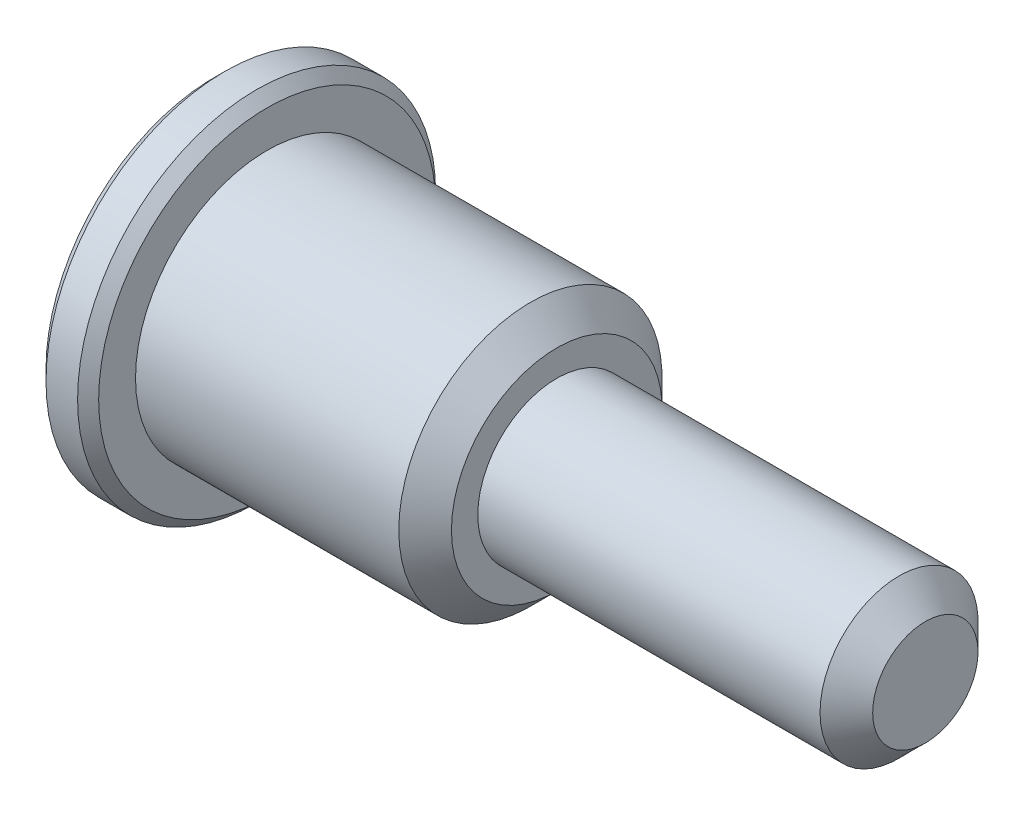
ISO-10303-21;
HEADER;
FILE_DESCRIPTION(('STEP AP214'),'2;1');
FILE_NAME('part.step','',(''),(''),'','','');
FILE_SCHEMA(('AUTOMOTIVE_DESIGN { 1 0 10303 214 1 1 1 1 }'));
ENDSEC;
DATA;
#1=APPLICATION_CONTEXT('core data for automotive mechanical design processes');
#2=APPLICATION_PROTOCOL_DEFINITION('international standard','automotive_design',2000,#1);
#3=PRODUCT_CONTEXT('',#1,'mechanical');
#4=PRODUCT('Part','Part','',(#3));
#5=PRODUCT_RELATED_PRODUCT_CATEGORY('part','',(#4));
#6=PRODUCT_DEFINITION_FORMATION('','',#4);
#7=PRODUCT_DEFINITION_CONTEXT('part definition',#1,'design');
#8=PRODUCT_DEFINITION('design','',#6,#7);
#9=PRODUCT_DEFINITION_SHAPE('','',#8);
#10=(LENGTH_UNIT() NAMED_UNIT(*) SI_UNIT(.MILLI.,.METRE.));
#11=(NAMED_UNIT(*) PLANE_ANGLE_UNIT() SI_UNIT($,.RADIAN.));
#12=(NAMED_UNIT(*) SI_UNIT($,.STERADIAN.) SOLID_ANGLE_UNIT());
#13=UNCERTAINTY_MEASURE_WITH_UNIT(LENGTH_MEASURE(1.E-05),#10,'distance_accuracy_value','');
#14=(GEOMETRIC_REPRESENTATION_CONTEXT(3) GLOBAL_UNCERTAINTY_ASSIGNED_CONTEXT((#13)) GLOBAL_UNIT_ASSIGNED_CONTEXT((#10,
#11,#12)) REPRESENTATION_CONTEXT('',''));
#15=CARTESIAN_POINT('',(0.,0.,0.));
#16=DIRECTION('',(0.,0.,1.));
#17=DIRECTION('',(1.,0.,0.));
#18=AXIS2_PLACEMENT_3D('',#15,#16,#17);
#19=CARTESIAN_POINT('',(0.,0.,0.));
#20=DIRECTION('',(1.,0.,0.));
#21=DIRECTION('',(0.,0.,-1.));
#22=AXIS2_PLACEMENT_3D('',#19,#20,#21);
#23=PLANE('',#22);
#24=CARTESIAN_POINT('',(0.,0.,0.));
#25=DIRECTION('',(1.,0.,0.));
#26=DIRECTION('',(0.,0.,-1.));
#27=AXIS2_PLACEMENT_3D('',#24,#25,#26);
#28=CIRCLE('',#27,3.2);
#29=CARTESIAN_POINT('',(0.,0.,-3.2));
#30=VERTEX_POINT('',#29);
#31=EDGE_CURVE('E10',#30,#30,#28,.F.);
#32=ORIENTED_EDGE('',*,*,#31,.T.);
#33=EDGE_LOOP('',(#32));
#34=FACE_BOUND('',#33,.T.);
#35=ADVANCED_FACE('F33',(#34),#23,.F.);
#36=CARTESIAN_POINT('',(0.,0.,0.));
#37=DIRECTION('',(-1.,0.,0.));
#38=DIRECTION('',(0.,0.,1.));
#39=AXIS2_PLACEMENT_3D('',#36,#37,#38);
#40=CYLINDRICAL_SURFACE('',#39,3.4);
#41=CARTESIAN_POINT('',(0.800000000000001,0.,0.));
#42=DIRECTION('',(-1.,0.,0.));
#43=DIRECTION('',(0.,0.,1.));
#44=AXIS2_PLACEMENT_3D('',#41,#42,#43);
#45=CIRCLE('',#44,3.4);
#46=CARTESIAN_POINT('',(0.800000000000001,0.,3.4));
#47=VERTEX_POINT('',#46);
#48=EDGE_CURVE('E44',#47,#47,#45,.T.);
#49=ORIENTED_EDGE('',*,*,#48,.T.);
#50=EDGE_LOOP('',(#49));
#51=FACE_BOUND('',#50,.T.);
#52=CARTESIAN_POINT('',(0.199999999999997,0.,0.));
#53=DIRECTION('',(1.,0.,0.));
#54=DIRECTION('',(0.,0.,-1.));
#55=AXIS2_PLACEMENT_3D('',#52,#53,#54);
#56=CIRCLE('',#55,3.4);
#57=CARTESIAN_POINT('',(0.199999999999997,0.,-3.4));
#58=VERTEX_POINT('',#57);
#59=EDGE_CURVE('E48',#58,#58,#56,.T.);
#60=ORIENTED_EDGE('',*,*,#59,.T.);
#61=EDGE_LOOP('',(#60));
#62=FACE_BOUND('',#61,.T.);
#63=ADVANCED_FACE('F90',(#51,#62),#40,.T.);
#64=CARTESIAN_POINT('',(1.,3.4,0.));
#65=DIRECTION('',(-1.,0.,0.));
#66=DIRECTION('',(0.,0.,1.));
#67=AXIS2_PLACEMENT_3D('',#64,#65,#66);
#68=PLANE('',#67);
#69=CARTESIAN_POINT('',(1.,0.,0.));
#70=DIRECTION('',(-1.,0.,0.));
#71=DIRECTION('',(0.,0.,1.));
#72=AXIS2_PLACEMENT_3D('',#69,#70,#71);
#73=CIRCLE('',#72,3.2);
#74=CARTESIAN_POINT('',(1.,0.,3.2));
#75=VERTEX_POINT('',#74);
#76=EDGE_CURVE('E40',#75,#75,#73,.F.);
#77=ORIENTED_EDGE('',*,*,#76,.T.);
#78=EDGE_LOOP('',(#77));
#79=FACE_BOUND('',#78,.T.);
#80=CARTESIAN_POINT('',(1.,0.,0.));
#81=DIRECTION('',(-1.,0.,0.));
#82=DIRECTION('',(0.,0.,1.));
#83=AXIS2_PLACEMENT_3D('',#80,#81,#82);
#84=CIRCLE('',#83,2.5);
#85=CARTESIAN_POINT('',(1.,0.,2.5));
#86=VERTEX_POINT('',#85);
#87=EDGE_CURVE('E65',#86,#86,#84,.T.);
#88=ORIENTED_EDGE('',*,*,#87,.T.);
#89=EDGE_LOOP('',(#88));
#90=FACE_BOUND('',#89,.T.);
#91=ADVANCED_FACE('F95',(#79,#90),#68,.F.);
#92=CARTESIAN_POINT('',(0.,0.,0.));
#93=DIRECTION('',(-1.,0.,0.));
#94=DIRECTION('',(0.,0.,1.));
#95=AXIS2_PLACEMENT_3D('',#92,#93,#94);
#96=CYLINDRICAL_SURFACE('',#95,2.5);
#97=CARTESIAN_POINT('',(6.,0.,0.));
#98=DIRECTION('',(-1.,0.,0.));
#99=DIRECTION('',(0.,0.,1.));
#100=AXIS2_PLACEMENT_3D('',#97,#98,#99);
#101=CIRCLE('',#100,2.5);
#102=CARTESIAN_POINT('',(6.,0.,2.5));
#103=VERTEX_POINT('',#102);
#104=EDGE_CURVE('E62',#103,#103,#101,.T.);
#105=ORIENTED_EDGE('',*,*,#104,.T.);
#106=EDGE_LOOP('',(#105));
#107=FACE_BOUND('',#106,.T.);
#108=ORIENTED_EDGE('',*,*,#87,.F.);
#109=EDGE_LOOP('',(#108));
#110=FACE_BOUND('',#109,.T.);
#111=ADVANCED_FACE('F86',(#107,#110),#96,.T.);
#112=CARTESIAN_POINT('',(6.5,2.5,0.));
#113=DIRECTION('',(-1.,0.,0.));
#114=DIRECTION('',(0.,0.,1.));
#115=AXIS2_PLACEMENT_3D('',#112,#113,#114);
#116=PLANE('',#115);
#117=CARTESIAN_POINT('',(6.5,0.,0.));
#118=DIRECTION('',(-1.,0.,0.));
#119=DIRECTION('',(0.,0.,1.));
#120=AXIS2_PLACEMENT_3D('',#117,#118,#119);
#121=CIRCLE('',#120,2.);
#122=CARTESIAN_POINT('',(6.5,0.,2.));
#123=VERTEX_POINT('',#122);
#124=EDGE_CURVE('E59',#123,#123,#121,.F.);
#125=ORIENTED_EDGE('',*,*,#124,.T.);
#126=EDGE_LOOP('',(#125));
#127=FACE_BOUND('',#126,.T.);
#128=CARTESIAN_POINT('',(6.5,0.,0.));
#129=DIRECTION('',(-1.,0.,0.));
#130=DIRECTION('',(0.,0.,1.));
#131=AXIS2_PLACEMENT_3D('',#128,#129,#130);
#132=CIRCLE('',#131,1.5);
#133=CARTESIAN_POINT('',(6.5,0.,1.5));
#134=VERTEX_POINT('',#133);
#135=EDGE_CURVE('E68',#134,#134,#132,.T.);
#136=ORIENTED_EDGE('',*,*,#135,.T.);
#137=EDGE_LOOP('',(#136));
#138=FACE_BOUND('',#137,.T.);
#139=ADVANCED_FACE('F72',(#127,#138),#116,.F.);
#140=CARTESIAN_POINT('',(0.,0.,0.));
#141=DIRECTION('',(-1.,0.,0.));
#142=DIRECTION('',(0.,0.,1.));
#143=AXIS2_PLACEMENT_3D('',#140,#141,#142);
#144=CYLINDRICAL_SURFACE('',#143,1.5);
#145=CARTESIAN_POINT('',(13.,0.,0.));
#146=DIRECTION('',(-1.,0.,0.));
#147=DIRECTION('',(0.,0.,1.));
#148=AXIS2_PLACEMENT_3D('',#145,#146,#147);
#149=CIRCLE('',#148,1.5);
#150=CARTESIAN_POINT('',(13.,0.,1.5));
#151=VERTEX_POINT('',#150);
#152=EDGE_CURVE('E56',#151,#151,#149,.T.);
#153=ORIENTED_EDGE('',*,*,#152,.T.);
#154=EDGE_LOOP('',(#153));
#155=FACE_BOUND('',#154,.T.);
#156=ORIENTED_EDGE('',*,*,#135,.F.);
#157=EDGE_LOOP('',(#156));
#158=FACE_BOUND('',#157,.T.);
#159=ADVANCED_FACE('F74',(#155,#158),#144,.T.);
#160=CARTESIAN_POINT('',(13.5,1.5,0.));
#161=DIRECTION('',(-1.,0.,0.));
#162=DIRECTION('',(0.,0.,1.));
#163=AXIS2_PLACEMENT_3D('',#160,#161,#162);
#164=PLANE('',#163);
#165=CARTESIAN_POINT('',(13.5,0.,0.));
#166=DIRECTION('',(-1.,0.,0.));
#167=DIRECTION('',(0.,0.,1.));
#168=AXIS2_PLACEMENT_3D('',#165,#166,#167);
#169=CIRCLE('',#168,0.999999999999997);
#170=CARTESIAN_POINT('',(13.5,0.,0.999999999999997));
#171=VERTEX_POINT('',#170);
#172=EDGE_CURVE('E53',#171,#171,#169,.F.);
#173=ORIENTED_EDGE('',*,*,#172,.T.);
#174=EDGE_LOOP('',(#173));
#175=FACE_BOUND('',#174,.T.);
#176=ADVANCED_FACE('F76',(#175),#164,.F.);
#177=CARTESIAN_POINT('',(6.,0.,0.));
#178=DIRECTION('',(-1.,0.,0.));
#179=DIRECTION('',(0.,0.,1.));
#180=AXIS2_PLACEMENT_3D('',#177,#178,#179);
#181=CONICAL_SURFACE('',#180,2.5,0.785398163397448);
#182=ORIENTED_EDGE('',*,*,#124,.F.);
#183=EDGE_LOOP('',(#182));
#184=FACE_BOUND('',#183,.T.);
#185=ORIENTED_EDGE('',*,*,#104,.F.);
#186=EDGE_LOOP('',(#185));
#187=FACE_BOUND('',#186,.T.);
#188=ADVANCED_FACE('F83',(#184,#187),#181,.T.);
#189=CARTESIAN_POINT('',(13.,0.,0.));
#190=DIRECTION('',(-1.,0.,0.));
#191=DIRECTION('',(0.,0.,1.));
#192=AXIS2_PLACEMENT_3D('',#189,#190,#191);
#193=CONICAL_SURFACE('',#192,1.5,0.78539816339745);
#194=ORIENTED_EDGE('',*,*,#172,.F.);
#195=EDGE_LOOP('',(#194));
#196=FACE_BOUND('',#195,.T.);
#197=ORIENTED_EDGE('',*,*,#152,.F.);
#198=EDGE_LOOP('',(#197));
#199=FACE_BOUND('',#198,.T.);
#200=ADVANCED_FACE('F102',(#196,#199),#193,.T.);
#201=CARTESIAN_POINT('',(0.800000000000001,0.,0.));
#202=DIRECTION('',(-1.,0.,0.));
#203=DIRECTION('',(0.,0.,1.));
#204=AXIS2_PLACEMENT_3D('',#201,#202,#203);
#205=CONICAL_SURFACE('',#204,3.4,0.785398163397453);
#206=ORIENTED_EDGE('',*,*,#76,.F.);
#207=EDGE_LOOP('',(#206));
#208=FACE_BOUND('',#207,.T.);
#209=ORIENTED_EDGE('',*,*,#48,.F.);
#210=EDGE_LOOP('',(#209));
#211=FACE_BOUND('',#210,.T.);
#212=ADVANCED_FACE('F105',(#208,#211),#205,.T.);
#213=CARTESIAN_POINT('',(0.,0.,0.));
#214=DIRECTION('',(1.,0.,0.));
#215=DIRECTION('',(0.,0.,-1.));
#216=AXIS2_PLACEMENT_3D('',#213,#214,#215);
#217=CONICAL_SURFACE('',#216,3.2,0.785398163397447);
#218=ORIENTED_EDGE('',*,*,#59,.F.);
#219=EDGE_LOOP('',(#218));
#220=FACE_BOUND('',#219,.T.);
#221=ORIENTED_EDGE('',*,*,#31,.F.);
#222=EDGE_LOOP('',(#221));
#223=FACE_BOUND('',#222,.T.);
#224=ADVANCED_FACE('F35',(#220,#223),#217,.T.);
#225=CLOSED_SHELL('',(#35,#63,#91,#111,#139,#159,#176,#188,#200,#212,#224));
#226=MANIFOLD_SOLID_BREP('B2',#225);
#227=ADVANCED_BREP_SHAPE_REPRESENTATION('',(#18,#226),#14);
#228=SHAPE_DEFINITION_REPRESENTATION(#9,#227);
ENDSEC;
END-ISO-10303-21;
